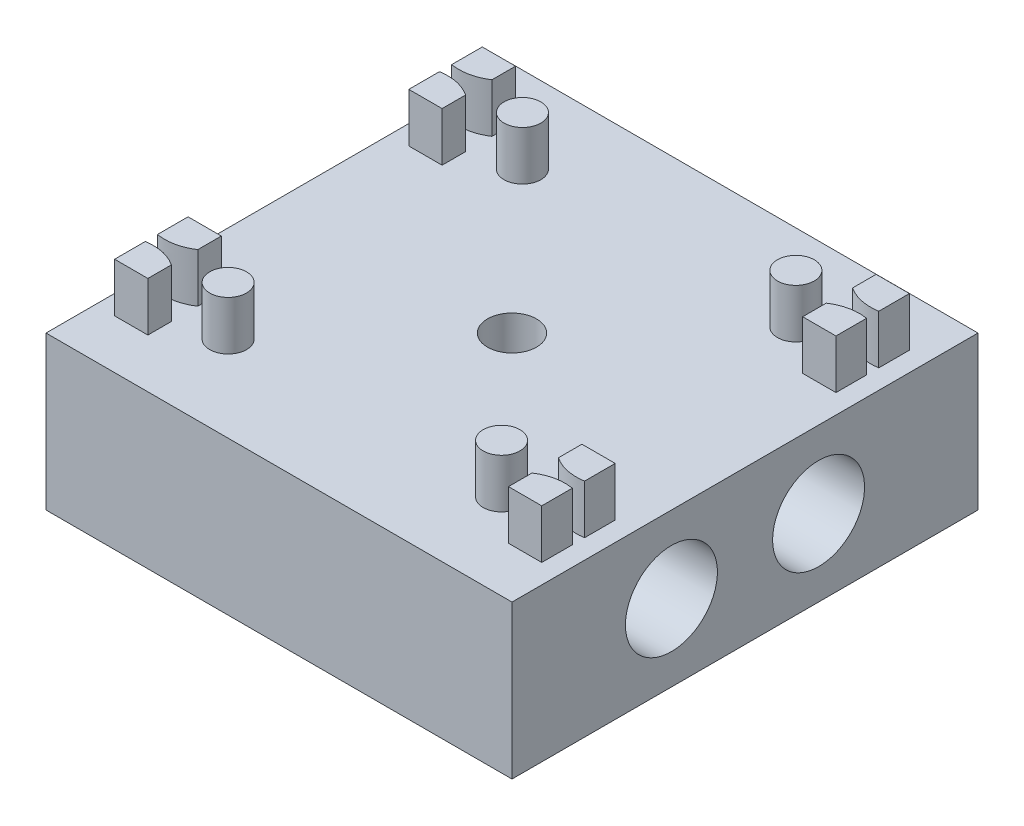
from build123d import *

# Parameters (mm, degrees)
SCHIZZO2_W                   = 76
SCHIZZO2_H                   = 76
SCHIZZO2_R                   = 4
ESTRUSIONE_ESTRUSIONE1_DEPTH = 25
SCHIZZO7_R                   = 3
ESTRUSIONE_ESTRUSIONE2_DEPTH = 8
SCHIZZO8_R                   = 7.5
TAGLIO_ESTRUSIONE1_DEPTH     = 76


with BuildPart() as part:
    # Schizzo2 → Estrusione-Estrusione1 (new body)
    with BuildSketch(Plane(origin=(0, 0, 0), x_dir=(1, 0, 0), z_dir=(0, 1, 0))):
        with Locations((13, -23)):
            Rectangle(SCHIZZO2_W, SCHIZZO2_H)
        with Locations(Location((13, -23, 0), (0, 0, 270))):
            Circle(SCHIZZO2_R, mode=Mode.SUBTRACT)
    extrude(amount=ESTRUSIONE_ESTRUSIONE1_DEPTH)

    # Schizzo7 → Estrusione-Estrusione2 (add)
    with BuildSketch(Plane(origin=(0, 25, 0), x_dir=(1, 0, 0), z_dir=(0, 1, 0))):
        with Locations(Location((-9.297222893, 1, 0), (0, 0, 270))):
            Circle(SCHIZZO7_R)
        with Locations(Location((35.297222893, 1, 0), (0, 0, 90))):
            Circle(SCHIZZO7_R)
        with Locations(Location((35.297222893, -47, 0), (0, 0, 270))):
            Circle(SCHIZZO7_R)
        with Locations(Location((-9.297222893, -47, 0), (0, 0, 90))):
            Circle(SCHIZZO7_R)
        with BuildLine():
            Line((-21.831300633, 6.981828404), (-16.404191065, 6.981828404))
            Line((-16.404191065, 6.981828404), (-16.404191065, 3.142130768))
            add(Edge.make_bspline(
                [(-21.831300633, 1.981828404), (-18.846584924, 1.541738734), (-16.404191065, 3.142130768)],
                knots=[0, 0, 0, 1, 1, 1], degree=2))
            Line((-21.831300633, 1.981828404), (-21.831300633, 6.981828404))
        make_face()
        with BuildLine():
            Line((-21.831300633, -4.998171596), (-21.831300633, 0.001828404))
            add(Edge.make_bspline(
                [(-21.831300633, 0.001828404), (-18.846584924, 0.441918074), (-16.404191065, -1.15847396)],
                knots=[0, 0, 0, 1, 1, 1], degree=2))
            Line((-16.404191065, -1.15847396), (-16.404191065, -4.998171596))
            Line((-16.404191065, -4.998171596), (-21.831300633, -4.998171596))
        make_face()
        with BuildLine():
            Line((42.404191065, -4.998171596), (42.404191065, -1.15847396))
            add(Edge.make_bspline(
                [(47.831300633, 0.001828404), (44.846584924, 0.441918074), (42.404191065, -1.15847396)],
                knots=[0, 0, 0, 1, 1, 1], degree=2))
            Line((47.831300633, 0.001828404), (47.831300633, -4.998171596))
            Line((47.831300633, -4.998171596), (42.404191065, -4.998171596))
        make_face()
        with BuildLine():
            Line((47.831300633, 6.981828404), (47.831300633, 1.981828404))
            add(Edge.make_bspline(
                [(47.831300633, 1.981828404), (44.846584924, 1.541738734), (42.404191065, 3.142130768)],
                knots=[0, 0, 0, 1, 1, 1], degree=2))
            Line((42.404191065, 3.142130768), (42.404191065, 6.981828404))
            Line((42.404191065, 6.981828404), (47.831300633, 6.981828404))
        make_face()
        with BuildLine():
            Line((47.831300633, -52.981828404), (47.831300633, -47.981828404))
            add(Edge.make_bspline(
                [(47.831300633, -47.981828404), (44.846584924, -47.541738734), (42.404191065, -49.142130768)],
                knots=[0, 0, 0, 1, 1, 1], degree=2))
            Line((42.404191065, -49.142130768), (42.404191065, -52.981828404))
            Line((42.404191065, -52.981828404), (47.831300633, -52.981828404))
        make_face()
        with BuildLine():
            Line((47.831300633, -41.001828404), (47.831300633, -46.001828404))
            add(Edge.make_bspline(
                [(47.831300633, -46.001828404), (44.846584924, -46.441918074), (42.404191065, -44.84152604)],
                knots=[0, 0, 0, 1, 1, 1], degree=2))
            Line((42.404191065, -44.84152604), (42.404191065, -41.001828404))
            Line((42.404191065, -41.001828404), (47.831300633, -41.001828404))
        make_face()
        with BuildLine():
            Line((-16.404191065, -41.001828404), (-16.404191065, -44.84152604))
            add(Edge.make_bspline(
                [(-21.831300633, -46.001828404), (-18.846584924, -46.441918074), (-16.404191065, -44.84152604)],
                knots=[0, 0, 0, 1, 1, 1], degree=2))
            Line((-21.831300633, -46.001828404), (-21.831300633, -41.001828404))
            Line((-21.831300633, -41.001828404), (-16.404191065, -41.001828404))
        make_face()
        with BuildLine():
            Line((-21.831300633, -52.981828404), (-21.831300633, -47.981828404))
            add(Edge.make_bspline(
                [(-21.831300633, -47.981828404), (-18.846584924, -47.541738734), (-16.404191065, -49.142130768)],
                knots=[0, 0, 0, 1, 1, 1], degree=2))
            Line((-16.404191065, -49.142130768), (-16.404191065, -52.981828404))
            Line((-16.404191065, -52.981828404), (-21.831300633, -52.981828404))
        make_face()
    extrude(amount=ESTRUSIONE_ESTRUSIONE2_DEPTH)

    # Schizzo8 → Taglio-Estrusione1 (cut)
    with BuildSketch(Plane.ZY.offset(25)):
        with Locations((11, 12.5)):
            Circle(SCHIZZO8_R)
        with Locations((35, 12.5)):
            Circle(SCHIZZO8_R)
    extrude(amount=-TAGLIO_ESTRUSIONE1_DEPTH, mode=Mode.SUBTRACT)


solid = part.part
